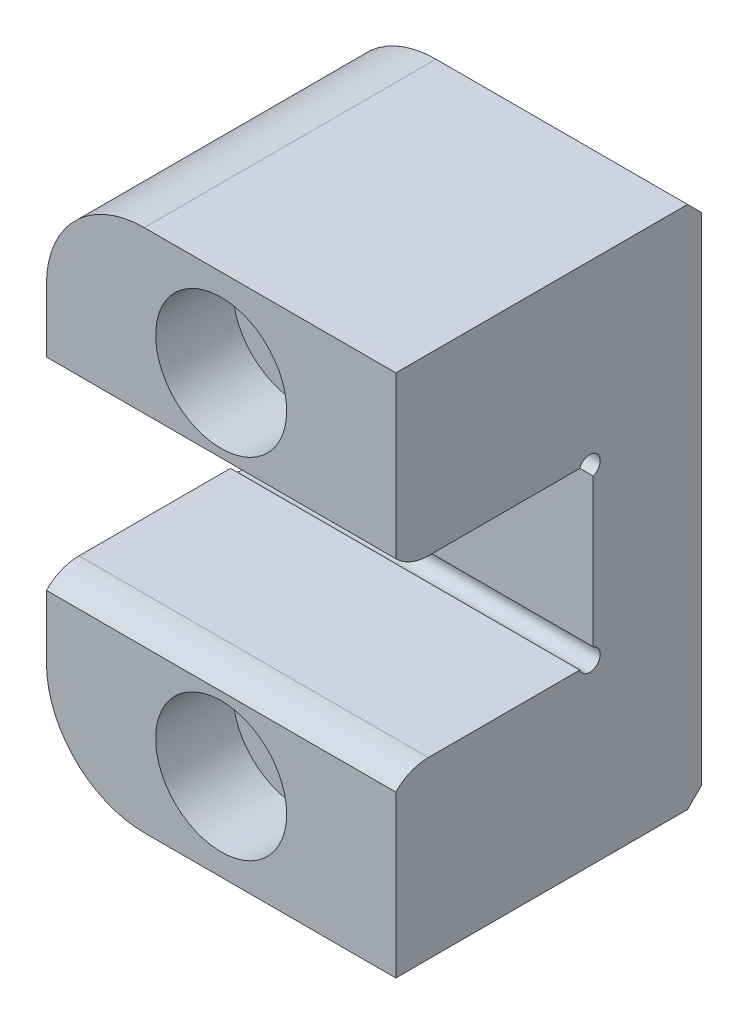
ISO-10303-21;
HEADER;
FILE_DESCRIPTION(('STEP AP214'),'2;1');
FILE_NAME('part.step','',(''),(''),'','','');
FILE_SCHEMA(('AUTOMOTIVE_DESIGN { 1 0 10303 214 1 1 1 1 }'));
ENDSEC;
DATA;
#1=APPLICATION_CONTEXT('core data for automotive mechanical design processes');
#2=APPLICATION_PROTOCOL_DEFINITION('international standard','automotive_design',2000,#1);
#3=PRODUCT_CONTEXT('',#1,'mechanical');
#4=PRODUCT('Part','Part','',(#3));
#5=PRODUCT_RELATED_PRODUCT_CATEGORY('part','',(#4));
#6=PRODUCT_DEFINITION_FORMATION('','',#4);
#7=PRODUCT_DEFINITION_CONTEXT('part definition',#1,'design');
#8=PRODUCT_DEFINITION('design','',#6,#7);
#9=PRODUCT_DEFINITION_SHAPE('','',#8);
#10=(LENGTH_UNIT() NAMED_UNIT(*) SI_UNIT(.MILLI.,.METRE.));
#11=(NAMED_UNIT(*) PLANE_ANGLE_UNIT() SI_UNIT($,.RADIAN.));
#12=(NAMED_UNIT(*) SI_UNIT($,.STERADIAN.) SOLID_ANGLE_UNIT());
#13=UNCERTAINTY_MEASURE_WITH_UNIT(LENGTH_MEASURE(1.E-05),#10,'distance_accuracy_value','');
#14=(GEOMETRIC_REPRESENTATION_CONTEXT(3) GLOBAL_UNCERTAINTY_ASSIGNED_CONTEXT((#13)) GLOBAL_UNIT_ASSIGNED_CONTEXT((#10,
#11,#12)) REPRESENTATION_CONTEXT('',''));
#15=CARTESIAN_POINT('',(0.,0.,0.));
#16=DIRECTION('',(0.,0.,1.));
#17=DIRECTION('',(1.,0.,0.));
#18=AXIS2_PLACEMENT_3D('',#15,#16,#17);
#19=CARTESIAN_POINT('',(12.7,6.35,-14.351));
#20=DIRECTION('',(0.,0.,-1.));
#21=DIRECTION('',(-1.,0.,0.));
#22=AXIS2_PLACEMENT_3D('',#19,#20,#21);
#23=PLANE('',#22);
#24=DIRECTION('',(-0.866025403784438,0.500000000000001,0.));
#25=VECTOR('',#24,1.);
#26=CARTESIAN_POINT('',(5.66259233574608,-5.83914762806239,-14.351));
#27=LINE('',#26,#25);
#28=CARTESIAN_POINT('',(-10.0916135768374,3.25654739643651,-14.351));
#29=VERTEX_POINT('',#28);
#30=CARTESIAN_POINT('',(-12.7,4.7625,-14.351));
#31=VERTEX_POINT('',#30);
#32=EDGE_CURVE('E340',#29,#31,#27,.T.);
#33=ORIENTED_EDGE('',*,*,#32,.F.);
#34=DIRECTION('',(0.,-1.,0.));
#35=VECTOR('',#34,1.);
#36=CARTESIAN_POINT('',(-10.0916135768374,-3.84595644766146,-14.351));
#37=LINE('',#36,#35);
#38=CARTESIAN_POINT('',(-10.0916135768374,-3.25654739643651,-14.351));
#39=VERTEX_POINT('',#38);
#40=EDGE_CURVE('E255',#29,#39,#37,.T.);
#41=ORIENTED_EDGE('',*,*,#40,.T.);
#42=DIRECTION('',(0.866025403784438,0.500000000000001,0.));
#43=VECTOR('',#42,1.);
#44=CARTESIAN_POINT('',(11.1618536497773,9.01414762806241,-14.351));
#45=LINE('',#44,#43);
#46=CARTESIAN_POINT('',(-12.7,-4.76249999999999,-14.351));
#47=VERTEX_POINT('',#46);
#48=EDGE_CURVE('E338',#47,#39,#45,.T.);
#49=ORIENTED_EDGE('',*,*,#48,.F.);
#50=DIRECTION('',(0.,-1.,0.));
#51=VECTOR('',#50,1.);
#52=CARTESIAN_POINT('',(-12.7,6.35,-14.351));
#53=LINE('',#52,#51);
#54=CARTESIAN_POINT('',(-12.7,-5.37757951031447,-14.351));
#55=VERTEX_POINT('',#54);
#56=EDGE_CURVE('E221',#47,#55,#53,.T.);
#57=ORIENTED_EDGE('',*,*,#56,.T.);
#58=DIRECTION('',(1.,0.,0.));
#59=VECTOR('',#58,1.);
#60=CARTESIAN_POINT('',(-12.7,-5.37757951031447,-14.351));
#61=LINE('',#60,#59);
#62=CARTESIAN_POINT('',(12.7,-5.37757951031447,-14.351));
#63=VERTEX_POINT('',#62);
#64=EDGE_CURVE('E194',#55,#63,#61,.T.);
#65=ORIENTED_EDGE('',*,*,#64,.T.);
#66=DIRECTION('',(0.,-1.,0.));
#67=VECTOR('',#66,1.);
#68=CARTESIAN_POINT('',(12.7,6.35,-14.351));
#69=LINE('',#68,#67);
#70=CARTESIAN_POINT('',(12.7,5.37757951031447,-14.351));
#71=VERTEX_POINT('',#70);
#72=EDGE_CURVE('E348',#71,#63,#69,.T.);
#73=ORIENTED_EDGE('',*,*,#72,.F.);
#74=DIRECTION('',(1.,0.,0.));
#75=VECTOR('',#74,1.);
#76=CARTESIAN_POINT('',(-12.7,5.37757951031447,-14.351));
#77=LINE('',#76,#75);
#78=CARTESIAN_POINT('',(-12.7,5.37757951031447,-14.351));
#79=VERTEX_POINT('',#78);
#80=EDGE_CURVE('E416',#71,#79,#77,.F.);
#81=ORIENTED_EDGE('',*,*,#80,.T.);
#82=EDGE_CURVE('E215',#79,#31,#53,.T.);
#83=ORIENTED_EDGE('',*,*,#82,.T.);
#84=EDGE_LOOP('',(#33,#41,#49,#57,#65,#73,#81,#83));
#85=FACE_BOUND('',#84,.T.);
#86=ADVANCED_FACE('F32',(#85),#23,.F.);
#87=CARTESIAN_POINT('',(12.7,19.05,-22.225));
#88=DIRECTION('',(0.,0.,1.));
#89=DIRECTION('',(1.,0.,0.));
#90=AXIS2_PLACEMENT_3D('',#87,#88,#89);
#91=PLANE('',#90);
#92=CARTESIAN_POINT('',(0.,12.7,-22.225));
#93=DIRECTION('',(0.,0.,1.));
#94=DIRECTION('',(1.,0.,0.));
#95=AXIS2_PLACEMENT_3D('',#92,#93,#94);
#96=CIRCLE('',#95,2.80669999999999);
#97=CARTESIAN_POINT('',(2.80669999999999,12.7,-22.225));
#98=VERTEX_POINT('',#97);
#99=EDGE_CURVE('E720',#98,#98,#96,.T.);
#100=ORIENTED_EDGE('',*,*,#99,.T.);
#101=EDGE_LOOP('',(#100));
#102=FACE_BOUND('',#101,.T.);
#103=CARTESIAN_POINT('',(0.,-12.7,-22.225));
#104=DIRECTION('',(0.,0.,1.));
#105=DIRECTION('',(1.,0.,0.));
#106=AXIS2_PLACEMENT_3D('',#103,#104,#105);
#107=CIRCLE('',#106,2.80669999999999);
#108=CARTESIAN_POINT('',(2.80669999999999,-12.7,-22.225));
#109=VERTEX_POINT('',#108);
#110=EDGE_CURVE('E706',#109,#109,#107,.T.);
#111=ORIENTED_EDGE('',*,*,#110,.T.);
#112=EDGE_LOOP('',(#111));
#113=FACE_BOUND('',#112,.T.);
#114=CARTESIAN_POINT('',(-5.588,-11.938,-22.225));
#115=DIRECTION('',(0.,0.,1.));
#116=DIRECTION('',(1.,0.,0.));
#117=AXIS2_PLACEMENT_3D('',#114,#115,#116);
#118=CIRCLE('',#117,6.09600000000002);
#119=CARTESIAN_POINT('',(-5.588,-18.034,-22.225));
#120=VERTEX_POINT('',#119);
#121=CARTESIAN_POINT('',(-11.684,-11.938,-22.225));
#122=VERTEX_POINT('',#121);
#123=EDGE_CURVE('E271',#120,#122,#118,.F.);
#124=ORIENTED_EDGE('',*,*,#123,.T.);
#125=DIRECTION('',(0.,1.,0.));
#126=VECTOR('',#125,1.);
#127=CARTESIAN_POINT('',(-11.684,-4.76249999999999,-22.225));
#128=LINE('',#127,#126);
#129=CARTESIAN_POINT('',(-11.684,-4.17591212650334,-22.225));
#130=VERTEX_POINT('',#129);
#131=EDGE_CURVE('E273',#122,#130,#128,.T.);
#132=ORIENTED_EDGE('',*,*,#131,.T.);
#133=DIRECTION('',(0.866025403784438,0.500000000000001,0.));
#134=VECTOR('',#133,1.);
#135=CARTESIAN_POINT('',(-11.1125,-3.84595644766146,-22.225));
#136=LINE('',#135,#134);
#137=CARTESIAN_POINT('',(-11.1125,-3.84595644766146,-22.225));
#138=VERTEX_POINT('',#137);
#139=EDGE_CURVE('E324',#130,#138,#136,.T.);
#140=ORIENTED_EDGE('',*,*,#139,.T.);
#141=DIRECTION('',(0.,1.,0.));
#142=VECTOR('',#141,1.);
#143=CARTESIAN_POINT('',(-11.1125,3.84595644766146,-22.225));
#144=LINE('',#143,#142);
#145=CARTESIAN_POINT('',(-11.1125,3.84595644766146,-22.225));
#146=VERTEX_POINT('',#145);
#147=EDGE_CURVE('E323',#138,#146,#144,.T.);
#148=ORIENTED_EDGE('',*,*,#147,.T.);
#149=DIRECTION('',(-0.866025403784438,0.500000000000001,0.));
#150=VECTOR('',#149,1.);
#151=CARTESIAN_POINT('',(-11.1125,3.84595644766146,-22.225));
#152=LINE('',#151,#150);
#153=CARTESIAN_POINT('',(-11.684,4.17591212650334,-22.225));
#154=VERTEX_POINT('',#153);
#155=EDGE_CURVE('E317',#146,#154,#152,.T.);
#156=ORIENTED_EDGE('',*,*,#155,.T.);
#157=DIRECTION('',(0.,1.,0.));
#158=VECTOR('',#157,1.);
#159=CARTESIAN_POINT('',(-11.684,11.938,-22.225));
#160=LINE('',#159,#158);
#161=CARTESIAN_POINT('',(-11.684,11.938,-22.225));
#162=VERTEX_POINT('',#161);
#163=EDGE_CURVE('E265',#154,#162,#160,.T.);
#164=ORIENTED_EDGE('',*,*,#163,.T.);
#165=CARTESIAN_POINT('',(-5.588,11.938,-22.225));
#166=DIRECTION('',(0.,0.,1.));
#167=DIRECTION('',(1.,0.,0.));
#168=AXIS2_PLACEMENT_3D('',#165,#166,#167);
#169=CIRCLE('',#168,6.096);
#170=CARTESIAN_POINT('',(-5.588,18.034,-22.225));
#171=VERTEX_POINT('',#170);
#172=EDGE_CURVE('E263',#162,#171,#169,.F.);
#173=ORIENTED_EDGE('',*,*,#172,.T.);
#174=DIRECTION('',(1.,0.,0.));
#175=VECTOR('',#174,1.);
#176=CARTESIAN_POINT('',(12.7,18.034,-22.225));
#177=LINE('',#176,#175);
#178=CARTESIAN_POINT('',(12.7,18.034,-22.225));
#179=VERTEX_POINT('',#178);
#180=EDGE_CURVE('E267',#171,#179,#177,.T.);
#181=ORIENTED_EDGE('',*,*,#180,.T.);
#182=DIRECTION('',(0.,1.,0.));
#183=VECTOR('',#182,1.);
#184=CARTESIAN_POINT('',(12.7,19.05,-22.225));
#185=LINE('',#184,#183);
#186=CARTESIAN_POINT('',(12.7,-18.034,-22.225));
#187=VERTEX_POINT('',#186);
#188=EDGE_CURVE('E357',#187,#179,#185,.T.);
#189=ORIENTED_EDGE('',*,*,#188,.F.);
#190=DIRECTION('',(-1.,0.,0.));
#191=VECTOR('',#190,1.);
#192=CARTESIAN_POINT('',(12.7,-18.034,-22.225));
#193=LINE('',#192,#191);
#194=EDGE_CURVE('E269',#187,#120,#193,.T.);
#195=ORIENTED_EDGE('',*,*,#194,.T.);
#196=EDGE_LOOP('',(#124,#132,#140,#148,#156,#164,#173,#181,#189,#195));
#197=FACE_BOUND('',#196,.T.);
#198=ADVANCED_FACE('F321',(#102,#113,#197),#91,.F.);
#199=CARTESIAN_POINT('',(-12.7,-6.35,0.));
#200=DIRECTION('',(-1.,0.,0.));
#201=DIRECTION('',(0.,0.,1.));
#202=AXIS2_PLACEMENT_3D('',#199,#200,#201);
#203=PLANE('',#202);
#204=DIRECTION('',(0.,0.,1.));
#205=VECTOR('',#204,1.);
#206=CARTESIAN_POINT('',(-12.7,11.938,-22.225));
#207=LINE('',#206,#205);
#208=CARTESIAN_POINT('',(-12.7,11.938,0.));
#209=VERTEX_POINT('',#208);
#210=CARTESIAN_POINT('',(-12.7,11.938,-21.209));
#211=VERTEX_POINT('',#210);
#212=EDGE_CURVE('E235',#209,#211,#207,.F.);
#213=ORIENTED_EDGE('',*,*,#212,.T.);
#214=DIRECTION('',(0.,-1.,0.));
#215=VECTOR('',#214,1.);
#216=CARTESIAN_POINT('',(-12.7,4.7625,-21.209));
#217=LINE('',#216,#215);
#218=CARTESIAN_POINT('',(-12.7,4.7625,-21.209));
#219=VERTEX_POINT('',#218);
#220=EDGE_CURVE('E49',#211,#219,#217,.T.);
#221=ORIENTED_EDGE('',*,*,#220,.T.);
#222=DIRECTION('',(0.,0.,1.));
#223=VECTOR('',#222,1.);
#224=CARTESIAN_POINT('',(-12.7,4.7625,0.));
#225=LINE('',#224,#223);
#226=EDGE_CURVE('E247',#219,#31,#225,.T.);
#227=ORIENTED_EDGE('',*,*,#226,.T.);
#228=ORIENTED_EDGE('',*,*,#82,.F.);
#229=CARTESIAN_POINT('',(-12.7,6.096,-14.097));
#230=DIRECTION('',(1.,0.,0.));
#231=DIRECTION('',(0.,0.,-1.));
#232=AXIS2_PLACEMENT_3D('',#229,#230,#231);
#233=CIRCLE('',#232,0.762000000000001);
#234=CARTESIAN_POINT('',(-12.7,6.35,-13.3785795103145));
#235=VERTEX_POINT('',#234);
#236=EDGE_CURVE('E423',#79,#235,#233,.T.);
#237=ORIENTED_EDGE('',*,*,#236,.T.);
#238=DIRECTION('',(0.,0.,-1.));
#239=VECTOR('',#238,1.);
#240=CARTESIAN_POINT('',(-12.7,6.35,0.));
#241=LINE('',#240,#239);
#242=CARTESIAN_POINT('',(-12.7,6.35,-2.36219999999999));
#243=VERTEX_POINT('',#242);
#244=EDGE_CURVE('E362',#243,#235,#241,.T.);
#245=ORIENTED_EDGE('',*,*,#244,.F.);
#246=CARTESIAN_POINT('',(-12.7,9.64915342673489,-2.36219999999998));
#247=DIRECTION('',(-1.,0.,0.));
#248=DIRECTION('',(0.,0.,-1.));
#249=AXIS2_PLACEMENT_3D('',#246,#247,#248);
#250=CIRCLE('',#249,3.29915342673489);
#251=CARTESIAN_POINT('',(-12.7,7.3460198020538,0.));
#252=VERTEX_POINT('',#251);
#253=EDGE_CURVE('E415',#243,#252,#250,.T.);
#254=ORIENTED_EDGE('',*,*,#253,.T.);
#255=DIRECTION('',(0.,-1.,0.));
#256=VECTOR('',#255,1.);
#257=CARTESIAN_POINT('',(-12.7,19.05,0.));
#258=LINE('',#257,#256);
#259=EDGE_CURVE('E342',#209,#252,#258,.T.);
#260=ORIENTED_EDGE('',*,*,#259,.F.);
#261=EDGE_LOOP('',(#213,#221,#227,#228,#237,#245,#254,#260));
#262=FACE_BOUND('',#261,.T.);
#263=ADVANCED_FACE('F459',(#262),#203,.T.);
#264=DIRECTION('',(0.,0.,-1.));
#265=VECTOR('',#264,1.);
#266=CARTESIAN_POINT('',(-12.7,-4.76249999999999,0.));
#267=LINE('',#266,#265);
#268=CARTESIAN_POINT('',(-12.7,-4.76249999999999,-21.209));
#269=VERTEX_POINT('',#268);
#270=EDGE_CURVE('E245',#47,#269,#267,.T.);
#271=ORIENTED_EDGE('',*,*,#270,.T.);
#272=DIRECTION('',(0.,-1.,0.));
#273=VECTOR('',#272,1.);
#274=CARTESIAN_POINT('',(-12.7,-11.938,-21.209));
#275=LINE('',#274,#273);
#276=CARTESIAN_POINT('',(-12.7,-11.938,-21.209));
#277=VERTEX_POINT('',#276);
#278=EDGE_CURVE('E278',#269,#277,#275,.T.);
#279=ORIENTED_EDGE('',*,*,#278,.T.);
#280=DIRECTION('',(0.,0.,-1.));
#281=VECTOR('',#280,1.);
#282=CARTESIAN_POINT('',(-12.7,-11.938,0.));
#283=LINE('',#282,#281);
#284=CARTESIAN_POINT('',(-12.7,-11.938,0.));
#285=VERTEX_POINT('',#284);
#286=EDGE_CURVE('E237',#277,#285,#283,.F.);
#287=ORIENTED_EDGE('',*,*,#286,.T.);
#288=DIRECTION('',(0.,-1.,0.));
#289=VECTOR('',#288,1.);
#290=CARTESIAN_POINT('',(-12.7,-6.35,0.));
#291=LINE('',#290,#289);
#292=CARTESIAN_POINT('',(-12.7,-7.3460198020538,0.));
#293=VERTEX_POINT('',#292);
#294=EDGE_CURVE('E214',#293,#285,#291,.T.);
#295=ORIENTED_EDGE('',*,*,#294,.F.);
#296=CARTESIAN_POINT('',(-12.7,-9.64915342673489,-2.36219999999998));
#297=DIRECTION('',(-1.,0.,0.));
#298=DIRECTION('',(0.,0.,1.));
#299=AXIS2_PLACEMENT_3D('',#296,#297,#298);
#300=CIRCLE('',#299,3.29915342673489);
#301=CARTESIAN_POINT('',(-12.7,-6.35,-2.36219999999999));
#302=VERTEX_POINT('',#301);
#303=EDGE_CURVE('E213',#293,#302,#300,.T.);
#304=ORIENTED_EDGE('',*,*,#303,.T.);
#305=DIRECTION('',(0.,0.,1.));
#306=VECTOR('',#305,1.);
#307=CARTESIAN_POINT('',(-12.7,-6.35,-14.351));
#308=LINE('',#307,#306);
#309=CARTESIAN_POINT('',(-12.7,-6.35,-13.3785795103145));
#310=VERTEX_POINT('',#309);
#311=EDGE_CURVE('E205',#310,#302,#308,.T.);
#312=ORIENTED_EDGE('',*,*,#311,.F.);
#313=CARTESIAN_POINT('',(-12.7,-6.096,-14.097));
#314=DIRECTION('',(1.,0.,0.));
#315=DIRECTION('',(0.,0.,1.));
#316=AXIS2_PLACEMENT_3D('',#313,#314,#315);
#317=CIRCLE('',#316,0.762000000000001);
#318=EDGE_CURVE('E188',#310,#55,#317,.T.);
#319=ORIENTED_EDGE('',*,*,#318,.T.);
#320=ORIENTED_EDGE('',*,*,#56,.F.);
#321=EDGE_LOOP('',(#271,#279,#287,#295,#304,#312,#319,#320));
#322=FACE_BOUND('',#321,.T.);
#323=ADVANCED_FACE('F211',(#322),#203,.T.);
#324=CARTESIAN_POINT('',(12.7,19.05,0.));
#325=DIRECTION('',(0.,0.,-1.));
#326=DIRECTION('',(0.,1.,0.));
#327=AXIS2_PLACEMENT_3D('',#324,#325,#326);
#328=PLANE('',#327);
#329=CARTESIAN_POINT('',(0.,12.7,0.));
#330=DIRECTION('',(0.,0.,1.));
#331=DIRECTION('',(1.,0.,0.));
#332=AXIS2_PLACEMENT_3D('',#329,#330,#331);
#333=CIRCLE('',#332,4.7625);
#334=CARTESIAN_POINT('',(4.7625,12.7,0.));
#335=VERTEX_POINT('',#334);
#336=EDGE_CURVE('E298',#335,#335,#333,.T.);
#337=ORIENTED_EDGE('',*,*,#336,.F.);
#338=EDGE_LOOP('',(#337));
#339=FACE_BOUND('',#338,.T.);
#340=ORIENTED_EDGE('',*,*,#259,.T.);
#341=DIRECTION('',(1.,0.,0.));
#342=VECTOR('',#341,1.);
#343=CARTESIAN_POINT('',(-12.7,7.3460198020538,0.));
#344=LINE('',#343,#342);
#345=CARTESIAN_POINT('',(12.7,7.3460198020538,0.));
#346=VERTEX_POINT('',#345);
#347=EDGE_CURVE('E410',#252,#346,#344,.T.);
#348=ORIENTED_EDGE('',*,*,#347,.T.);
#349=DIRECTION('',(0.,-1.,0.));
#350=VECTOR('',#349,1.);
#351=CARTESIAN_POINT('',(12.7,19.05,0.));
#352=LINE('',#351,#350);
#353=CARTESIAN_POINT('',(12.7,19.05,0.));
#354=VERTEX_POINT('',#353);
#355=EDGE_CURVE('E218',#354,#346,#352,.T.);
#356=ORIENTED_EDGE('',*,*,#355,.F.);
#357=DIRECTION('',(-1.,0.,0.));
#358=VECTOR('',#357,1.);
#359=CARTESIAN_POINT('',(12.7,19.05,0.));
#360=LINE('',#359,#358);
#361=CARTESIAN_POINT('',(-5.588,19.05,0.));
#362=VERTEX_POINT('',#361);
#363=EDGE_CURVE('E225',#354,#362,#360,.T.);
#364=ORIENTED_EDGE('',*,*,#363,.T.);
#365=CARTESIAN_POINT('',(-5.588,11.938,0.));
#366=DIRECTION('',(0.,0.,-1.));
#367=DIRECTION('',(0.,1.,0.));
#368=AXIS2_PLACEMENT_3D('',#365,#366,#367);
#369=CIRCLE('',#368,7.112);
#370=EDGE_CURVE('E243',#362,#209,#369,.F.);
#371=ORIENTED_EDGE('',*,*,#370,.T.);
#372=EDGE_LOOP('',(#340,#348,#356,#364,#371));
#373=FACE_BOUND('',#372,.T.);
#374=ADVANCED_FACE('F409',(#339,#373),#328,.F.);
#375=CARTESIAN_POINT('',(12.7,6.35,0.));
#376=DIRECTION('',(0.,1.,0.));
#377=DIRECTION('',(0.,0.,1.));
#378=AXIS2_PLACEMENT_3D('',#375,#376,#377);
#379=PLANE('',#378);
#380=ORIENTED_EDGE('',*,*,#244,.T.);
#381=DIRECTION('',(1.,0.,0.));
#382=VECTOR('',#381,1.);
#383=CARTESIAN_POINT('',(-12.7,6.35,-13.3785795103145));
#384=LINE('',#383,#382);
#385=CARTESIAN_POINT('',(12.7,6.35,-13.3785795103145));
#386=VERTEX_POINT('',#385);
#387=EDGE_CURVE('E420',#235,#386,#384,.T.);
#388=ORIENTED_EDGE('',*,*,#387,.T.);
#389=DIRECTION('',(0.,0.,-1.));
#390=VECTOR('',#389,1.);
#391=CARTESIAN_POINT('',(12.7,6.35,0.));
#392=LINE('',#391,#390);
#393=CARTESIAN_POINT('',(12.7,6.35,-2.36219999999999));
#394=VERTEX_POINT('',#393);
#395=EDGE_CURVE('E345',#394,#386,#392,.T.);
#396=ORIENTED_EDGE('',*,*,#395,.F.);
#397=DIRECTION('',(1.,0.,0.));
#398=VECTOR('',#397,1.);
#399=CARTESIAN_POINT('',(-12.7,6.35,-2.36219999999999));
#400=LINE('',#399,#398);
#401=EDGE_CURVE('E419',#243,#394,#400,.T.);
#402=ORIENTED_EDGE('',*,*,#401,.F.);
#403=EDGE_LOOP('',(#380,#388,#396,#402));
#404=FACE_BOUND('',#403,.T.);
#405=ADVANCED_FACE('F418',(#404),#379,.F.);
#406=CARTESIAN_POINT('',(12.7,-6.35,-14.351));
#407=DIRECTION('',(0.,-1.,0.));
#408=DIRECTION('',(0.,0.,-1.));
#409=AXIS2_PLACEMENT_3D('',#406,#407,#408);
#410=PLANE('',#409);
#411=DIRECTION('',(0.,0.,1.));
#412=VECTOR('',#411,1.);
#413=CARTESIAN_POINT('',(12.7,-6.35,-14.351));
#414=LINE('',#413,#412);
#415=CARTESIAN_POINT('',(12.7,-6.35,-13.3785795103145));
#416=VERTEX_POINT('',#415);
#417=CARTESIAN_POINT('',(12.7,-6.35,-2.36219999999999));
#418=VERTEX_POINT('',#417);
#419=EDGE_CURVE('E207',#416,#418,#414,.T.);
#420=ORIENTED_EDGE('',*,*,#419,.F.);
#421=DIRECTION('',(1.,0.,0.));
#422=VECTOR('',#421,1.);
#423=CARTESIAN_POINT('',(-12.7,-6.35,-13.3785795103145));
#424=LINE('',#423,#422);
#425=EDGE_CURVE('E191',#416,#310,#424,.F.);
#426=ORIENTED_EDGE('',*,*,#425,.T.);
#427=ORIENTED_EDGE('',*,*,#311,.T.);
#428=DIRECTION('',(1.,0.,0.));
#429=VECTOR('',#428,1.);
#430=CARTESIAN_POINT('',(-12.7,-6.35,-2.36219999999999));
#431=LINE('',#430,#429);
#432=EDGE_CURVE('E328',#302,#418,#431,.T.);
#433=ORIENTED_EDGE('',*,*,#432,.T.);
#434=EDGE_LOOP('',(#420,#426,#427,#433));
#435=FACE_BOUND('',#434,.T.);
#436=ADVANCED_FACE('F203',(#435),#410,.F.);
#437=CARTESIAN_POINT('',(12.7,-6.35,0.));
#438=DIRECTION('',(0.,0.,-1.));
#439=DIRECTION('',(0.,1.,0.));
#440=AXIS2_PLACEMENT_3D('',#437,#438,#439);
#441=PLANE('',#440);
#442=CARTESIAN_POINT('',(0.,-12.7,0.));
#443=DIRECTION('',(0.,0.,1.));
#444=DIRECTION('',(1.,0.,0.));
#445=AXIS2_PLACEMENT_3D('',#442,#443,#444);
#446=CIRCLE('',#445,4.7625);
#447=CARTESIAN_POINT('',(4.7625,-12.7,0.));
#448=VERTEX_POINT('',#447);
#449=EDGE_CURVE('E717',#448,#448,#446,.T.);
#450=ORIENTED_EDGE('',*,*,#449,.F.);
#451=EDGE_LOOP('',(#450));
#452=FACE_BOUND('',#451,.T.);
#453=DIRECTION('',(0.,-1.,0.));
#454=VECTOR('',#453,1.);
#455=CARTESIAN_POINT('',(12.7,-6.35,0.));
#456=LINE('',#455,#454);
#457=CARTESIAN_POINT('',(12.7,-7.3460198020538,0.));
#458=VERTEX_POINT('',#457);
#459=CARTESIAN_POINT('',(12.7,-19.05,0.));
#460=VERTEX_POINT('',#459);
#461=EDGE_CURVE('E352',#458,#460,#456,.T.);
#462=ORIENTED_EDGE('',*,*,#461,.F.);
#463=DIRECTION('',(1.,0.,0.));
#464=VECTOR('',#463,1.);
#465=CARTESIAN_POINT('',(-12.7,-7.3460198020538,0.));
#466=LINE('',#465,#464);
#467=EDGE_CURVE('E325',#293,#458,#466,.T.);
#468=ORIENTED_EDGE('',*,*,#467,.F.);
#469=ORIENTED_EDGE('',*,*,#294,.T.);
#470=CARTESIAN_POINT('',(-5.588,-11.938,0.));
#471=DIRECTION('',(0.,0.,-1.));
#472=DIRECTION('',(0.,1.,0.));
#473=AXIS2_PLACEMENT_3D('',#470,#471,#472);
#474=CIRCLE('',#473,7.112);
#475=CARTESIAN_POINT('',(-5.588,-19.05,0.));
#476=VERTEX_POINT('',#475);
#477=EDGE_CURVE('E239',#285,#476,#474,.F.);
#478=ORIENTED_EDGE('',*,*,#477,.T.);
#479=DIRECTION('',(-1.,0.,0.));
#480=VECTOR('',#479,1.);
#481=CARTESIAN_POINT('',(12.7,-19.05,0.));
#482=LINE('',#481,#480);
#483=EDGE_CURVE('E228',#460,#476,#482,.T.);
#484=ORIENTED_EDGE('',*,*,#483,.F.);
#485=EDGE_LOOP('',(#462,#468,#469,#478,#484));
#486=FACE_BOUND('',#485,.T.);
#487=ADVANCED_FACE('F443',(#452,#486),#441,.F.);
#488=CARTESIAN_POINT('',(12.7,-19.05,0.));
#489=DIRECTION('',(0.,1.,0.));
#490=DIRECTION('',(0.,0.,1.));
#491=AXIS2_PLACEMENT_3D('',#488,#489,#490);
#492=PLANE('',#491);
#493=DIRECTION('',(0.,0.,-1.));
#494=VECTOR('',#493,1.);
#495=CARTESIAN_POINT('',(-5.588,-19.05,-22.225));
#496=LINE('',#495,#494);
#497=CARTESIAN_POINT('',(-5.588,-19.05,-21.209));
#498=VERTEX_POINT('',#497);
#499=EDGE_CURVE('E232',#476,#498,#496,.T.);
#500=ORIENTED_EDGE('',*,*,#499,.T.);
#501=DIRECTION('',(1.,0.,0.));
#502=VECTOR('',#501,1.);
#503=CARTESIAN_POINT('',(12.7,-19.05,-21.209));
#504=LINE('',#503,#502);
#505=CARTESIAN_POINT('',(12.7,-19.05,-21.209));
#506=VERTEX_POINT('',#505);
#507=EDGE_CURVE('E282',#498,#506,#504,.T.);
#508=ORIENTED_EDGE('',*,*,#507,.T.);
#509=DIRECTION('',(0.,0.,-1.));
#510=VECTOR('',#509,1.);
#511=CARTESIAN_POINT('',(12.7,-19.05,0.));
#512=LINE('',#511,#510);
#513=EDGE_CURVE('E354',#460,#506,#512,.T.);
#514=ORIENTED_EDGE('',*,*,#513,.F.);
#515=ORIENTED_EDGE('',*,*,#483,.T.);
#516=EDGE_LOOP('',(#500,#508,#514,#515));
#517=FACE_BOUND('',#516,.T.);
#518=ADVANCED_FACE('F389',(#517),#492,.F.);
#519=CARTESIAN_POINT('',(12.7,19.05,0.));
#520=DIRECTION('',(0.,-1.,0.));
#521=DIRECTION('',(0.,0.,-1.));
#522=AXIS2_PLACEMENT_3D('',#519,#520,#521);
#523=PLANE('',#522);
#524=DIRECTION('',(0.,0.,1.));
#525=VECTOR('',#524,1.);
#526=CARTESIAN_POINT('',(12.7,19.05,0.));
#527=LINE('',#526,#525);
#528=CARTESIAN_POINT('',(12.7,19.05,-21.209));
#529=VERTEX_POINT('',#528);
#530=EDGE_CURVE('E229',#529,#354,#527,.T.);
#531=ORIENTED_EDGE('',*,*,#530,.F.);
#532=DIRECTION('',(-1.,0.,0.));
#533=VECTOR('',#532,1.);
#534=CARTESIAN_POINT('',(12.7,19.05,-21.209));
#535=LINE('',#534,#533);
#536=CARTESIAN_POINT('',(-5.588,19.05,-21.209));
#537=VERTEX_POINT('',#536);
#538=EDGE_CURVE('E288',#529,#537,#535,.T.);
#539=ORIENTED_EDGE('',*,*,#538,.T.);
#540=DIRECTION('',(0.,0.,1.));
#541=VECTOR('',#540,1.);
#542=CARTESIAN_POINT('',(-5.588,19.05,0.));
#543=LINE('',#542,#541);
#544=EDGE_CURVE('E241',#537,#362,#543,.T.);
#545=ORIENTED_EDGE('',*,*,#544,.T.);
#546=ORIENTED_EDGE('',*,*,#363,.F.);
#547=EDGE_LOOP('',(#531,#539,#545,#546));
#548=FACE_BOUND('',#547,.T.);
#549=ADVANCED_FACE('F404',(#548),#523,.F.);
#550=CARTESIAN_POINT('',(12.7,-6.35,0.));
#551=DIRECTION('',(-1.,0.,0.));
#552=DIRECTION('',(0.,0.,1.));
#553=AXIS2_PLACEMENT_3D('',#550,#551,#552);
#554=PLANE('',#553);
#555=ORIENTED_EDGE('',*,*,#513,.T.);
#556=DIRECTION('',(0.,-0.707106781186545,0.70710678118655));
#557=VECTOR('',#556,1.);
#558=CARTESIAN_POINT('',(12.7,-18.034,-22.225));
#559=LINE('',#558,#557);
#560=EDGE_CURVE('E286',#506,#187,#559,.F.);
#561=ORIENTED_EDGE('',*,*,#560,.T.);
#562=ORIENTED_EDGE('',*,*,#188,.T.);
#563=DIRECTION('',(0.,-0.707106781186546,-0.707106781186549));
#564=VECTOR('',#563,1.);
#565=CARTESIAN_POINT('',(12.7,19.05,-21.209));
#566=LINE('',#565,#564);
#567=EDGE_CURVE('E284',#179,#529,#566,.F.);
#568=ORIENTED_EDGE('',*,*,#567,.T.);
#569=ORIENTED_EDGE('',*,*,#530,.T.);
#570=ORIENTED_EDGE('',*,*,#355,.T.);
#571=CARTESIAN_POINT('',(12.7,9.64915342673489,-2.36219999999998));
#572=DIRECTION('',(-1.,0.,0.));
#573=DIRECTION('',(0.,0.,-1.));
#574=AXIS2_PLACEMENT_3D('',#571,#572,#573);
#575=CIRCLE('',#574,3.29915342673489);
#576=EDGE_CURVE('E412',#394,#346,#575,.T.);
#577=ORIENTED_EDGE('',*,*,#576,.F.);
#578=ORIENTED_EDGE('',*,*,#395,.T.);
#579=CARTESIAN_POINT('',(12.7,6.096,-14.097));
#580=DIRECTION('',(-1.,0.,0.));
#581=DIRECTION('',(0.,0.,1.));
#582=AXIS2_PLACEMENT_3D('',#579,#580,#581);
#583=CIRCLE('',#582,0.762000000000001);
#584=EDGE_CURVE('E249',#386,#71,#583,.T.);
#585=ORIENTED_EDGE('',*,*,#584,.T.);
#586=ORIENTED_EDGE('',*,*,#72,.T.);
#587=CARTESIAN_POINT('',(12.7,-6.096,-14.097));
#588=DIRECTION('',(1.,0.,0.));
#589=DIRECTION('',(0.,0.,1.));
#590=AXIS2_PLACEMENT_3D('',#587,#588,#589);
#591=CIRCLE('',#590,0.762000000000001);
#592=EDGE_CURVE('E199',#416,#63,#591,.T.);
#593=ORIENTED_EDGE('',*,*,#592,.F.);
#594=ORIENTED_EDGE('',*,*,#419,.T.);
#595=CARTESIAN_POINT('',(12.7,-9.64915342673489,-2.36219999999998));
#596=DIRECTION('',(-1.,0.,0.));
#597=DIRECTION('',(0.,0.,1.));
#598=AXIS2_PLACEMENT_3D('',#595,#596,#597);
#599=CIRCLE('',#598,3.29915342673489);
#600=EDGE_CURVE('E433',#458,#418,#599,.T.);
#601=ORIENTED_EDGE('',*,*,#600,.F.);
#602=ORIENTED_EDGE('',*,*,#461,.T.);
#603=EDGE_LOOP('',(#555,#561,#562,#568,#569,#570,#577,#578,#585,#586,#593,#594,#601,#602));
#604=FACE_BOUND('',#603,.T.);
#605=ADVANCED_FACE('F398',(#604),#554,.F.);
#606=CARTESIAN_POINT('',(-5.588,-11.938,0.));
#607=DIRECTION('',(0.,0.,1.));
#608=DIRECTION('',(1.,0.,0.));
#609=AXIS2_PLACEMENT_3D('',#606,#607,#608);
#610=CYLINDRICAL_SURFACE('',#609,7.112);
#611=ORIENTED_EDGE('',*,*,#286,.F.);
#612=CARTESIAN_POINT('',(-5.588,-11.938,-21.209));
#613=DIRECTION('',(0.,0.,1.));
#614=DIRECTION('',(1.,0.,0.));
#615=AXIS2_PLACEMENT_3D('',#612,#613,#614);
#616=CIRCLE('',#615,7.112);
#617=EDGE_CURVE('E280',#277,#498,#616,.T.);
#618=ORIENTED_EDGE('',*,*,#617,.T.);
#619=ORIENTED_EDGE('',*,*,#499,.F.);
#620=ORIENTED_EDGE('',*,*,#477,.F.);
#621=EDGE_LOOP('',(#611,#618,#619,#620));
#622=FACE_BOUND('',#621,.T.);
#623=ADVANCED_FACE('F385',(#622),#610,.T.);
#624=CARTESIAN_POINT('',(-5.588,11.938,0.));
#625=DIRECTION('',(0.,0.,-1.));
#626=DIRECTION('',(-1.,0.,0.));
#627=AXIS2_PLACEMENT_3D('',#624,#625,#626);
#628=CYLINDRICAL_SURFACE('',#627,7.112);
#629=ORIENTED_EDGE('',*,*,#544,.F.);
#630=CARTESIAN_POINT('',(-5.588,11.938,-21.209));
#631=DIRECTION('',(0.,0.,1.));
#632=DIRECTION('',(1.,0.,0.));
#633=AXIS2_PLACEMENT_3D('',#630,#631,#632);
#634=CIRCLE('',#633,7.112);
#635=EDGE_CURVE('E11',#537,#211,#634,.T.);
#636=ORIENTED_EDGE('',*,*,#635,.T.);
#637=ORIENTED_EDGE('',*,*,#212,.F.);
#638=ORIENTED_EDGE('',*,*,#370,.F.);
#639=EDGE_LOOP('',(#629,#636,#637,#638));
#640=FACE_BOUND('',#639,.T.);
#641=ADVANCED_FACE('F470',(#640),#628,.T.);
#642=CARTESIAN_POINT('',(-11.1125,3.84595644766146,0.));
#643=DIRECTION('',(-1.,0.,0.));
#644=DIRECTION('',(0.,-1.,0.));
#645=AXIS2_PLACEMENT_3D('',#642,#643,#644);
#646=PLANE('',#645);
#647=DIRECTION('',(0.,0.,-1.));
#648=VECTOR('',#647,1.);
#649=CARTESIAN_POINT('',(-11.1125,-3.84595644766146,0.));
#650=LINE('',#649,#648);
#651=CARTESIAN_POINT('',(-11.1125,-3.84595644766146,-18.1610000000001));
#652=VERTEX_POINT('',#651);
#653=EDGE_CURVE('E335',#652,#138,#650,.T.);
#654=ORIENTED_EDGE('',*,*,#653,.F.);
#655=DIRECTION('',(0.,1.,0.));
#656=VECTOR('',#655,1.);
#657=CARTESIAN_POINT('',(-11.1125,3.84595644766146,-18.1610000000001));
#658=LINE('',#657,#656);
#659=CARTESIAN_POINT('',(-11.1125,3.84595644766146,-18.1610000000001));
#660=VERTEX_POINT('',#659);
#661=EDGE_CURVE('E252',#652,#660,#658,.T.);
#662=ORIENTED_EDGE('',*,*,#661,.T.);
#663=DIRECTION('',(0.,0.,-1.));
#664=VECTOR('',#663,1.);
#665=CARTESIAN_POINT('',(-11.1125,3.84595644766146,0.));
#666=LINE('',#665,#664);
#667=EDGE_CURVE('E333',#660,#146,#666,.T.);
#668=ORIENTED_EDGE('',*,*,#667,.T.);
#669=ORIENTED_EDGE('',*,*,#147,.F.);
#670=EDGE_LOOP('',(#654,#662,#668,#669));
#671=FACE_BOUND('',#670,.T.);
#672=ADVANCED_FACE('F473',(#671),#646,.T.);
#673=CARTESIAN_POINT('',(-11.1125,3.84595644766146,0.));
#674=DIRECTION('',(-0.500000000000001,-0.866025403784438,0.));
#675=DIRECTION('',(0.866025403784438,-0.500000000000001,0.));
#676=AXIS2_PLACEMENT_3D('',#673,#674,#675);
#677=PLANE('',#676);
#678=ORIENTED_EDGE('',*,*,#226,.F.);
#679=DIRECTION('',(0.654653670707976,-0.377964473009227,-0.654653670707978));
#680=VECTOR('',#679,1.);
#681=CARTESIAN_POINT('',(-20.8824285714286,9.48662733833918,-13.0265714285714));
#682=LINE('',#681,#680);
#683=EDGE_CURVE('E41',#219,#154,#682,.T.);
#684=ORIENTED_EDGE('',*,*,#683,.T.);
#685=ORIENTED_EDGE('',*,*,#155,.F.);
#686=ORIENTED_EDGE('',*,*,#667,.F.);
#687=DIRECTION('',(0.25597695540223,-0.147788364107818,0.955319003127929));
#688=VECTOR('',#687,1.);
#689=CARTESIAN_POINT('',(-11.1125,3.84595644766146,-18.1610000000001));
#690=LINE('',#689,#688);
#691=EDGE_CURVE('E258',#660,#29,#690,.T.);
#692=ORIENTED_EDGE('',*,*,#691,.T.);
#693=ORIENTED_EDGE('',*,*,#32,.T.);
#694=EDGE_LOOP('',(#678,#684,#685,#686,#692,#693));
#695=FACE_BOUND('',#694,.T.);
#696=ADVANCED_FACE('F315',(#695),#677,.T.);
#697=CARTESIAN_POINT('',(-11.1125,-3.84595644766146,0.));
#698=DIRECTION('',(-0.500000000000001,0.866025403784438,0.));
#699=DIRECTION('',(-0.866025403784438,-0.500000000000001,0.));
#700=AXIS2_PLACEMENT_3D('',#697,#698,#699);
#701=PLANE('',#700);
#702=ORIENTED_EDGE('',*,*,#139,.F.);
#703=DIRECTION('',(-0.654653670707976,-0.377964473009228,0.654653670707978));
#704=VECTOR('',#703,1.);
#705=CARTESIAN_POINT('',(-20.8824285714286,-9.48662733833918,-13.0265714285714));
#706=LINE('',#705,#704);
#707=EDGE_CURVE('E276',#130,#269,#706,.T.);
#708=ORIENTED_EDGE('',*,*,#707,.T.);
#709=ORIENTED_EDGE('',*,*,#270,.F.);
#710=ORIENTED_EDGE('',*,*,#48,.T.);
#711=DIRECTION('',(-0.25597695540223,-0.147788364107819,-0.955319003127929));
#712=VECTOR('',#711,1.);
#713=CARTESIAN_POINT('',(-10.8215117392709,-3.67795429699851,-17.075017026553));
#714=LINE('',#713,#712);
#715=EDGE_CURVE('E261',#39,#652,#714,.T.);
#716=ORIENTED_EDGE('',*,*,#715,.T.);
#717=ORIENTED_EDGE('',*,*,#653,.T.);
#718=EDGE_LOOP('',(#702,#708,#709,#710,#716,#717));
#719=FACE_BOUND('',#718,.T.);
#720=ADVANCED_FACE('F587',(#719),#701,.T.);
#721=CARTESIAN_POINT('',(-12.7,-9.64915342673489,-2.36219999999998));
#722=DIRECTION('',(1.,0.,0.));
#723=DIRECTION('',(0.,0.,-1.));
#724=AXIS2_PLACEMENT_3D('',#721,#722,#723);
#725=CYLINDRICAL_SURFACE('',#724,3.29915342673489);
#726=ORIENTED_EDGE('',*,*,#600,.T.);
#727=ORIENTED_EDGE('',*,*,#432,.F.);
#728=ORIENTED_EDGE('',*,*,#303,.F.);
#729=ORIENTED_EDGE('',*,*,#467,.T.);
#730=EDGE_LOOP('',(#726,#727,#728,#729));
#731=FACE_BOUND('',#730,.T.);
#732=ADVANCED_FACE('F439',(#731),#725,.T.);
#733=CARTESIAN_POINT('',(-12.7,9.64915342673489,-2.36219999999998));
#734=DIRECTION('',(1.,0.,0.));
#735=DIRECTION('',(0.,0.,-1.));
#736=AXIS2_PLACEMENT_3D('',#733,#734,#735);
#737=CYLINDRICAL_SURFACE('',#736,3.29915342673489);
#738=ORIENTED_EDGE('',*,*,#576,.T.);
#739=ORIENTED_EDGE('',*,*,#347,.F.);
#740=ORIENTED_EDGE('',*,*,#253,.F.);
#741=ORIENTED_EDGE('',*,*,#401,.T.);
#742=EDGE_LOOP('',(#738,#739,#740,#741));
#743=FACE_BOUND('',#742,.T.);
#744=ADVANCED_FACE('F572',(#743),#737,.T.);
#745=CARTESIAN_POINT('',(-12.7,6.096,-14.097));
#746=DIRECTION('',(1.,0.,0.));
#747=DIRECTION('',(0.,0.,-1.));
#748=AXIS2_PLACEMENT_3D('',#745,#746,#747);
#749=CYLINDRICAL_SURFACE('',#748,0.762000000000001);
#750=ORIENTED_EDGE('',*,*,#584,.F.);
#751=ORIENTED_EDGE('',*,*,#387,.F.);
#752=ORIENTED_EDGE('',*,*,#236,.F.);
#753=ORIENTED_EDGE('',*,*,#80,.F.);
#754=EDGE_LOOP('',(#750,#751,#752,#753));
#755=FACE_BOUND('',#754,.T.);
#756=ADVANCED_FACE('F564',(#755),#749,.F.);
#757=CARTESIAN_POINT('',(-12.7,-6.096,-14.097));
#758=DIRECTION('',(1.,0.,0.));
#759=DIRECTION('',(0.,0.,-1.));
#760=AXIS2_PLACEMENT_3D('',#757,#758,#759);
#761=CYLINDRICAL_SURFACE('',#760,0.762000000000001);
#762=ORIENTED_EDGE('',*,*,#318,.F.);
#763=ORIENTED_EDGE('',*,*,#425,.F.);
#764=ORIENTED_EDGE('',*,*,#592,.T.);
#765=ORIENTED_EDGE('',*,*,#64,.F.);
#766=EDGE_LOOP('',(#762,#763,#764,#765));
#767=FACE_BOUND('',#766,.T.);
#768=ADVANCED_FACE('F190',(#767),#761,.F.);
#769=CARTESIAN_POINT('',(0.,-12.7,0.));
#770=DIRECTION('',(0.,0.,1.));
#771=DIRECTION('',(1.,0.,0.));
#772=AXIS2_PLACEMENT_3D('',#769,#770,#771);
#773=CYLINDRICAL_SURFACE('',#772,2.8067);
#774=ORIENTED_EDGE('',*,*,#110,.F.);
#775=EDGE_LOOP('',(#774));
#776=FACE_BOUND('',#775,.T.);
#777=CARTESIAN_POINT('',(0.,-12.7,-5.61975));
#778=DIRECTION('',(0.,0.,1.));
#779=DIRECTION('',(1.,0.,0.));
#780=AXIS2_PLACEMENT_3D('',#777,#778,#779);
#781=CIRCLE('',#780,2.8067);
#782=CARTESIAN_POINT('',(2.8067,-12.7,-5.61975));
#783=VERTEX_POINT('',#782);
#784=EDGE_CURVE('E709',#783,#783,#781,.T.);
#785=ORIENTED_EDGE('',*,*,#784,.T.);
#786=EDGE_LOOP('',(#785));
#787=FACE_BOUND('',#786,.T.);
#788=ADVANCED_FACE('F549',(#776,#787),#773,.F.);
#789=CARTESIAN_POINT('',(2.8067,-12.7,-5.61975));
#790=DIRECTION('',(0.,0.,-1.));
#791=DIRECTION('',(-1.,0.,0.));
#792=AXIS2_PLACEMENT_3D('',#789,#790,#791);
#793=PLANE('',#792);
#794=ORIENTED_EDGE('',*,*,#784,.F.);
#795=EDGE_LOOP('',(#794));
#796=FACE_BOUND('',#795,.T.);
#797=CARTESIAN_POINT('',(0.,-12.7,-5.61975));
#798=DIRECTION('',(0.,0.,1.));
#799=DIRECTION('',(1.,0.,0.));
#800=AXIS2_PLACEMENT_3D('',#797,#798,#799);
#801=CIRCLE('',#800,4.7625);
#802=CARTESIAN_POINT('',(4.7625,-12.7,-5.61975));
#803=VERTEX_POINT('',#802);
#804=EDGE_CURVE('E714',#803,#803,#801,.T.);
#805=ORIENTED_EDGE('',*,*,#804,.T.);
#806=EDGE_LOOP('',(#805));
#807=FACE_BOUND('',#806,.T.);
#808=ADVANCED_FACE('F541',(#796,#807),#793,.F.);
#809=CARTESIAN_POINT('',(0.,-12.7,0.));
#810=DIRECTION('',(0.,0.,1.));
#811=DIRECTION('',(1.,0.,0.));
#812=AXIS2_PLACEMENT_3D('',#809,#810,#811);
#813=CYLINDRICAL_SURFACE('',#812,4.7625);
#814=ORIENTED_EDGE('',*,*,#804,.F.);
#815=EDGE_LOOP('',(#814));
#816=FACE_BOUND('',#815,.T.);
#817=ORIENTED_EDGE('',*,*,#449,.T.);
#818=EDGE_LOOP('',(#817));
#819=FACE_BOUND('',#818,.T.);
#820=ADVANCED_FACE('F533',(#816,#819),#813,.F.);
#821=CARTESIAN_POINT('',(0.,12.7,0.));
#822=DIRECTION('',(0.,0.,1.));
#823=DIRECTION('',(1.,0.,0.));
#824=AXIS2_PLACEMENT_3D('',#821,#822,#823);
#825=CYLINDRICAL_SURFACE('',#824,2.8067);
#826=ORIENTED_EDGE('',*,*,#99,.F.);
#827=EDGE_LOOP('',(#826));
#828=FACE_BOUND('',#827,.T.);
#829=CARTESIAN_POINT('',(0.,12.7,-5.61975));
#830=DIRECTION('',(0.,0.,1.));
#831=DIRECTION('',(1.,0.,0.));
#832=AXIS2_PLACEMENT_3D('',#829,#830,#831);
#833=CIRCLE('',#832,2.8067);
#834=CARTESIAN_POINT('',(2.8067,12.7,-5.61975));
#835=VERTEX_POINT('',#834);
#836=EDGE_CURVE('E723',#835,#835,#833,.T.);
#837=ORIENTED_EDGE('',*,*,#836,.T.);
#838=EDGE_LOOP('',(#837));
#839=FACE_BOUND('',#838,.T.);
#840=ADVANCED_FACE('F525',(#828,#839),#825,.F.);
#841=CARTESIAN_POINT('',(2.8067,12.7,-5.61975));
#842=DIRECTION('',(0.,0.,-1.));
#843=DIRECTION('',(-1.,0.,0.));
#844=AXIS2_PLACEMENT_3D('',#841,#842,#843);
#845=PLANE('',#844);
#846=ORIENTED_EDGE('',*,*,#836,.F.);
#847=EDGE_LOOP('',(#846));
#848=FACE_BOUND('',#847,.T.);
#849=CARTESIAN_POINT('',(0.,12.7,-5.61975));
#850=DIRECTION('',(0.,0.,1.));
#851=DIRECTION('',(1.,0.,0.));
#852=AXIS2_PLACEMENT_3D('',#849,#850,#851);
#853=CIRCLE('',#852,4.7625);
#854=CARTESIAN_POINT('',(4.7625,12.7,-5.61975));
#855=VERTEX_POINT('',#854);
#856=EDGE_CURVE('E726',#855,#855,#853,.T.);
#857=ORIENTED_EDGE('',*,*,#856,.T.);
#858=EDGE_LOOP('',(#857));
#859=FACE_BOUND('',#858,.T.);
#860=ADVANCED_FACE('F517',(#848,#859),#845,.F.);
#861=CARTESIAN_POINT('',(0.,12.7,0.));
#862=DIRECTION('',(0.,0.,1.));
#863=DIRECTION('',(1.,0.,0.));
#864=AXIS2_PLACEMENT_3D('',#861,#862,#863);
#865=CYLINDRICAL_SURFACE('',#864,4.7625);
#866=ORIENTED_EDGE('',*,*,#856,.F.);
#867=EDGE_LOOP('',(#866));
#868=FACE_BOUND('',#867,.T.);
#869=ORIENTED_EDGE('',*,*,#336,.T.);
#870=EDGE_LOOP('',(#869));
#871=FACE_BOUND('',#870,.T.);
#872=ADVANCED_FACE('F477',(#868,#871),#865,.F.);
#873=CARTESIAN_POINT('',(-11.1125,3.84595644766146,-18.1610000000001));
#874=DIRECTION('',(-0.965925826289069,0.,0.258819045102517));
#875=DIRECTION('',(0.258819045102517,0.,0.965925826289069));
#876=AXIS2_PLACEMENT_3D('',#873,#874,#875);
#877=PLANE('',#876);
#878=ORIENTED_EDGE('',*,*,#715,.F.);
#879=ORIENTED_EDGE('',*,*,#40,.F.);
#880=ORIENTED_EDGE('',*,*,#691,.F.);
#881=ORIENTED_EDGE('',*,*,#661,.F.);
#882=EDGE_LOOP('',(#878,#879,#880,#881));
#883=FACE_BOUND('',#882,.T.);
#884=ADVANCED_FACE('F474',(#883),#877,.T.);
#885=CARTESIAN_POINT('',(12.7,-18.034,-22.225));
#886=DIRECTION('',(0.,0.70710678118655,0.707106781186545));
#887=DIRECTION('',(0.,-0.707106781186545,0.70710678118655));
#888=AXIS2_PLACEMENT_3D('',#885,#886,#887);
#889=PLANE('',#888);
#890=ORIENTED_EDGE('',*,*,#560,.F.);
#891=ORIENTED_EDGE('',*,*,#507,.F.);
#892=DIRECTION('',(0.,-0.707106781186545,0.70710678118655));
#893=VECTOR('',#892,1.);
#894=CARTESIAN_POINT('',(-5.588,-18.034,-22.225));
#895=LINE('',#894,#893);
#896=EDGE_CURVE('E296',#120,#498,#895,.T.);
#897=ORIENTED_EDGE('',*,*,#896,.F.);
#898=ORIENTED_EDGE('',*,*,#194,.F.);
#899=EDGE_LOOP('',(#890,#891,#897,#898));
#900=FACE_BOUND('',#899,.T.);
#901=ADVANCED_FACE('F394',(#900),#889,.F.);
#902=CARTESIAN_POINT('',(-5.588,-11.938,-22.225));
#903=DIRECTION('',(0.,0.,1.));
#904=DIRECTION('',(1.,0.,0.));
#905=AXIS2_PLACEMENT_3D('',#902,#903,#904);
#906=CONICAL_SURFACE('',#905,6.09600000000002,0.785398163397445);
#907=ORIENTED_EDGE('',*,*,#896,.T.);
#908=ORIENTED_EDGE('',*,*,#617,.F.);
#909=DIRECTION('',(-0.707106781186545,0.,0.70710678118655));
#910=VECTOR('',#909,1.);
#911=CARTESIAN_POINT('',(-11.684,-11.938,-22.225));
#912=LINE('',#911,#910);
#913=EDGE_CURVE('E293',#122,#277,#912,.T.);
#914=ORIENTED_EDGE('',*,*,#913,.F.);
#915=ORIENTED_EDGE('',*,*,#123,.F.);
#916=EDGE_LOOP('',(#907,#908,#914,#915));
#917=FACE_BOUND('',#916,.T.);
#918=ADVANCED_FACE('F381',(#917),#906,.T.);
#919=CARTESIAN_POINT('',(-11.684,19.05,-22.225));
#920=DIRECTION('',(-0.707106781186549,0.,-0.707106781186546));
#921=DIRECTION('',(-0.707106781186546,0.,0.707106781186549));
#922=AXIS2_PLACEMENT_3D('',#919,#920,#921);
#923=PLANE('',#922);
#924=ORIENTED_EDGE('',*,*,#913,.T.);
#925=ORIENTED_EDGE('',*,*,#278,.F.);
#926=ORIENTED_EDGE('',*,*,#707,.F.);
#927=ORIENTED_EDGE('',*,*,#131,.F.);
#928=EDGE_LOOP('',(#924,#925,#926,#927));
#929=FACE_BOUND('',#928,.T.);
#930=ADVANCED_FACE('F375',(#929),#923,.T.);
#931=CARTESIAN_POINT('',(-11.684,19.05,-22.225));
#932=DIRECTION('',(-0.707106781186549,0.,-0.707106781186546));
#933=DIRECTION('',(-0.707106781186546,0.,0.707106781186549));
#934=AXIS2_PLACEMENT_3D('',#931,#932,#933);
#935=PLANE('',#934);
#936=ORIENTED_EDGE('',*,*,#683,.F.);
#937=ORIENTED_EDGE('',*,*,#220,.F.);
#938=DIRECTION('',(-0.707106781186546,0.,0.707106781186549));
#939=VECTOR('',#938,1.);
#940=CARTESIAN_POINT('',(-11.684,11.938,-22.225));
#941=LINE('',#940,#939);
#942=EDGE_CURVE('E36',#162,#211,#941,.T.);
#943=ORIENTED_EDGE('',*,*,#942,.F.);
#944=ORIENTED_EDGE('',*,*,#163,.F.);
#945=EDGE_LOOP('',(#936,#937,#943,#944));
#946=FACE_BOUND('',#945,.T.);
#947=ADVANCED_FACE('F34',(#946),#935,.T.);
#948=CARTESIAN_POINT('',(-5.588,11.938,-22.225));
#949=DIRECTION('',(0.,0.,1.));
#950=DIRECTION('',(1.,0.,0.));
#951=AXIS2_PLACEMENT_3D('',#948,#949,#950);
#952=CONICAL_SURFACE('',#951,6.096,0.785398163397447);
#953=ORIENTED_EDGE('',*,*,#942,.T.);
#954=ORIENTED_EDGE('',*,*,#635,.F.);
#955=DIRECTION('',(0.,0.707106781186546,0.707106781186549));
#956=VECTOR('',#955,1.);
#957=CARTESIAN_POINT('',(-5.588,18.034,-22.225));
#958=LINE('',#957,#956);
#959=EDGE_CURVE('E299',#171,#537,#958,.T.);
#960=ORIENTED_EDGE('',*,*,#959,.F.);
#961=ORIENTED_EDGE('',*,*,#172,.F.);
#962=EDGE_LOOP('',(#953,#954,#960,#961));
#963=FACE_BOUND('',#962,.T.);
#964=ADVANCED_FACE('F308',(#963),#952,.T.);
#965=CARTESIAN_POINT('',(12.7,19.05,-21.209));
#966=DIRECTION('',(0.,-0.707106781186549,0.707106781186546));
#967=DIRECTION('',(0.,-0.707106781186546,-0.707106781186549));
#968=AXIS2_PLACEMENT_3D('',#965,#966,#967);
#969=PLANE('',#968);
#970=ORIENTED_EDGE('',*,*,#567,.F.);
#971=ORIENTED_EDGE('',*,*,#180,.F.);
#972=ORIENTED_EDGE('',*,*,#959,.T.);
#973=ORIENTED_EDGE('',*,*,#538,.F.);
#974=EDGE_LOOP('',(#970,#971,#972,#973));
#975=FACE_BOUND('',#974,.T.);
#976=ADVANCED_FACE('F400',(#975),#969,.F.);
#977=CLOSED_SHELL('',(#86,#198,#263,#323,#374,#405,#436,#487,#518,#549,#605,#623,#641,#672,#696,
#720,#732,#744,#756,#768,#788,#808,#820,#840,#860,#872,#884,#901,#918,#930,#947,#964,#976));
#978=MANIFOLD_SOLID_BREP('B2',#977);
#979=ADVANCED_BREP_SHAPE_REPRESENTATION('',(#18,#978),#14);
#980=SHAPE_DEFINITION_REPRESENTATION(#9,#979);
ENDSEC;
END-ISO-10303-21;
